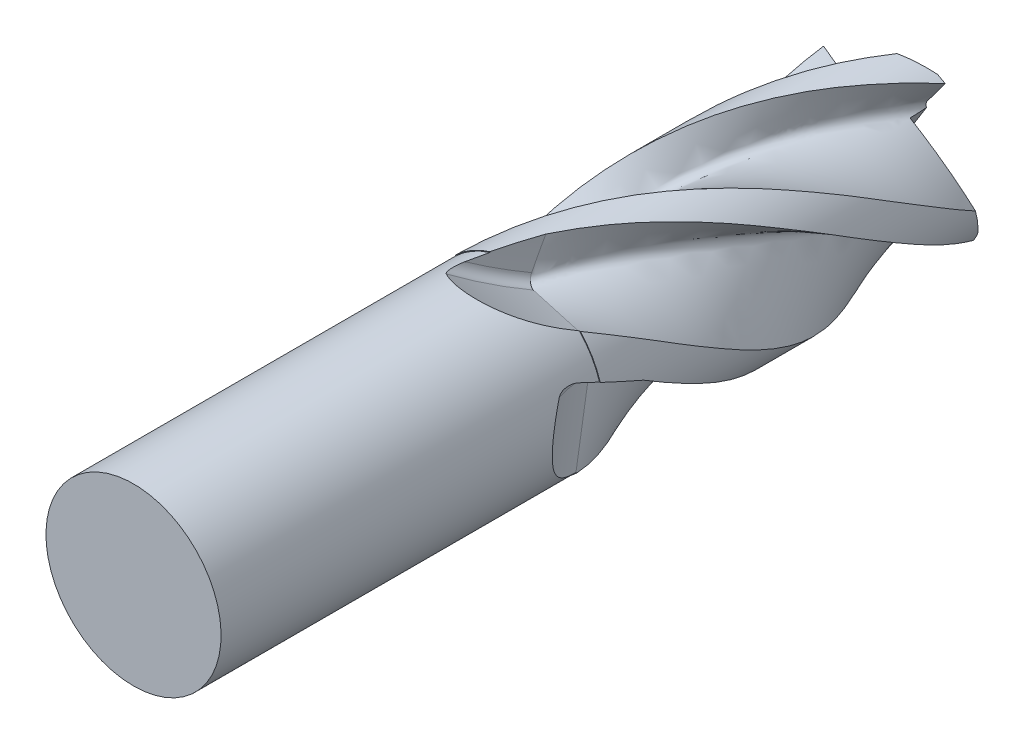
from build123d import *

# Parameters (mm, degrees)
FM2T_DENT_PITCH       = 5.44
FM2T_DENT_HEIGHT      = 2.666666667
FM2T_DENT_RADIUS      = 0.5
FM2T_DENT_START_ANGLE = 135
FM2T_DEG_ANGLE        = 90
PENTE_ANGLE           = 20
REPDENT_COUNT         = 4


with BuildPart() as part:
    # EsqCorps → CorpsOutil (revolve)
    with BuildSketch(Plane(origin=(0, 0, 0), x_dir=(0, 0, -1), z_dir=(1, 0, 0)), mode=Mode.PRIVATE) as corpsoutil_sk:
        Polygon((0, 0), (-4.333333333, 0), (-4.333333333, 0.496), (-2.166666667, 0.496), (-2.166666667, 0.5), (0, 0.5), align=None)
    revolve(corpsoutil_sk.sketch.rotate(Axis((0, 0, 0.300640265), (0, 0, -1)), 180), axis=Axis((0, 0, 0.300640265), (0, 0, -1)))

    # FM2T-Dent: sweep along a helix
    with BuildLine() as fm2t_dent_path:
        add(Helix(FM2T_DENT_PITCH, FM2T_DENT_HEIGHT, FM2T_DENT_RADIUS, center=(0, 0, 2.166666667), direction=(0, 0, -1), mode=Mode.PRIVATE).rotate(Axis((0, 0, 2.166666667), (0, 0, -1)), FM2T_DENT_START_ANGLE))
    # EsqDent → FM2T-Dent (sweep, cut)
    with BuildSketch(Plane(origin=(0.353553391, 0.353553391, 2.166666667), x_dir=(-0.9180097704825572, 0.04642664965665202, -0.3938307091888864), z_dir=(0.3536215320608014, -0.3536215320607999, -0.8659697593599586))):
        with BuildLine():
            Line((-0.557874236, 0.10624518), (0.398203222, -0.09375482))
            ThreePointArc((0.398203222, -0.09375482), (0.437834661, -0.085261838), (0.458151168, -0.050190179))
            ThreePointArc((0.458151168, -0.050190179), (0.475542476, 0.272370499), (0.458151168, 0.594931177))
            ThreePointArc((0.458151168, 0.594931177), (-0.125296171, 0.507424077), (-0.557874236, 0.10624518))
        make_face()
    fm2t_dent = sweep(path=fm2t_dent_path.line, is_frenet=True, mode=Mode.SUBTRACT)

    # Esquisse16 → FM2T-Deg (revolve, cut)
    with BuildSketch(Plane(origin=(0.353553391, 0.353553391, 2.166666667), x_dir=(-0.9180097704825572, 0.04642664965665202, -0.3938307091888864), z_dir=(0.3536215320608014, -0.3536215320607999, -0.8659697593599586))):
        with BuildLine():
            Line((-0.557874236, 0.10624518), (0.398203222, -0.09375482))
            ThreePointArc((0.398203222, -0.09375482), (0.437834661, -0.085261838), (0.458151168, -0.050190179))
            ThreePointArc((0.458151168, -0.050190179), (0.475542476, 0.272370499), (0.458151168, 0.594931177))
            ThreePointArc((0.458151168, 0.594931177), (-0.125296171, 0.507424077), (-0.557874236, 0.10624518))
        make_face()
    fm2t_deg = revolve(axis=Axis((0.570161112, 2.692520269, 1.29999449), (-0.9353077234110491, -0.14584737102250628, -0.3223786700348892)), revolution_arc=FM2T_DEG_ANGLE, mode=Mode.SUBTRACT)

    # EsqTrouCentral → TrouCentral (revolve, cut)
    with BuildSketch(Plane(origin=(0, 0, 0), x_dir=(0, 0, -1), z_dir=(1, 0, 0))):
        Polygon((0.2, 0), (-0.3, 0), (-0.260252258, -0.068845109), (0.2, -0.15), align=None)
    revolve(axis=Axis((0, 0, 0.418805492), (0, 0, -1)), mode=Mode.SUBTRACT)

    # EsqPente → Pente (revolve, cut)
    with BuildSketch(Plane(origin=(0, 0, 0), x_dir=(-1, 0, 0), z_dir=(0, 0, -1))):
        with BuildLine():
            Line((-0.026442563, 0.042435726), (-0.317310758, 0.509228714))
            ThreePointArc((-0.317310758, 0.509228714), (-0.578283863, 0.159961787), (-0.533900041, -0.273771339))
            Line((-0.533900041, -0.273771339), (-0.026442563, 0.042435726))
        make_face()
    pente = revolve(axis=Axis((0.524300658, -0.267789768, 0), (0.8487145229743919, -0.5288512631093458, -2.1541845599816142e-15)), revolution_arc=PENTE_ANGLE, mode=Mode.SUBTRACT)

    # Gorge: sweep along a curve in space
    with BuildLine() as gorge_path:
        Line((0.490463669, -0.158336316, 0.216506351), (0, 0, 0))
    # EsqGorge → Gorge (sweep, cut)
    with BuildSketch(Plane(origin=(0.424357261, -0.264425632, 0), x_dir=(0, 0, -1), z_dir=(-0.8487145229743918, 0.528851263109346, 2.274071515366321e-15))):
        with BuildLine():
            Line((-0.266506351, -0.03839746), (0.599519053, 0.46160254))
            Line((0.599519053, 0.46160254), (0.649519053, 0.375))
            Line((0.649519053, 0.375), (-0.216506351, -0.125))
            ThreePointArc((-0.216506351, -0.125), (-0.284807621, -0.10669873), (-0.266506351, -0.03839746))
        make_face()
    sweep(path=gorge_path.line, mode=Mode.SUBTRACT)

    # RepDent: FM2T-Dent, FM2T-Deg, Pente ×4 about axis
    repdent_axis = Axis((0, 0, 0), (0, 0, 1))
    add([fm2t_dent.rotate(repdent_axis, i * 360 / REPDENT_COUNT) for i in range(1, REPDENT_COUNT)], mode=Mode.SUBTRACT)
    add([fm2t_deg.rotate(repdent_axis, i * 360 / REPDENT_COUNT) for i in range(1, REPDENT_COUNT)], mode=Mode.SUBTRACT)
    add([pente.rotate(repdent_axis, i * 360 / REPDENT_COUNT) for i in range(1, REPDENT_COUNT)], mode=Mode.SUBTRACT)


solid = part.part
